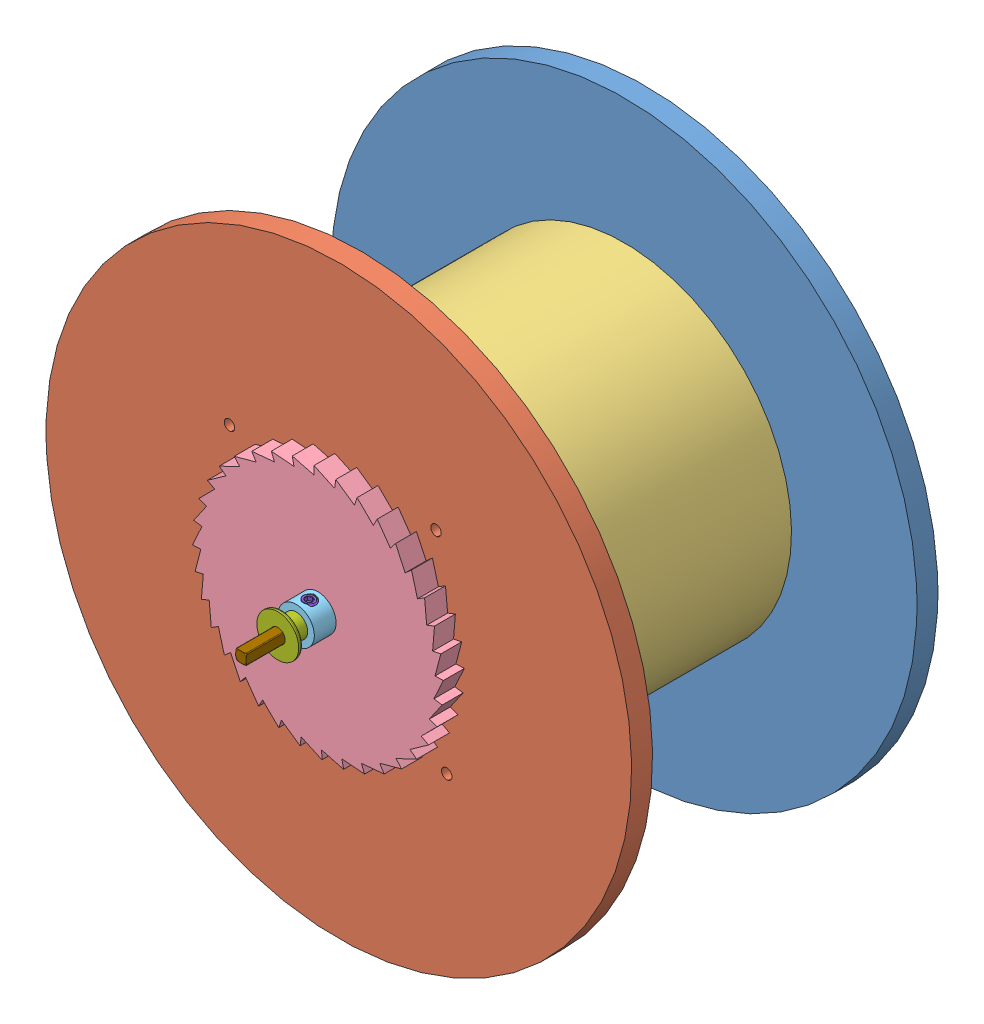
SolidWorks assembly Class Project Big Wheel.SLDASM, configuration Default (file format 10000). Lengths in mm.
Overall size (180.94 180.94 152.61).
12 component instances, 9 part files, 25 mates.
Components (placement in the parent):
- Big Spool part1-1: Big Spool part1.SLDPRT [Default] at (-48.379 96.7165 191.1816) size (177.8 177.8 6.35)
- Big Spool part2-1: Big Spool part2.SLDPRT [Default] at (-48.379 96.7165 277.7956) x (-0.999841 -0.017819 0) z (0 0 1) size (177.8 177.8 6.35)
- Big Spool part3-1: Big Spool part3.SLDPRT [Default] at (-48.379 96.7165 197.5316) x (-0.999916 -0.012987 0) z (0 0 1) size (101.6 101.6 80.26)
- Big Spool Rachet clamp-1: Big Spool Rachet clamp.SLDPRT [Default] at (-48.379 96.7165 290.4956) x (0.9995 0.031613 0) z (0 0 -1) size (76.2 76.2 12.7)
- Shaft Collar-1: Shaft Collar.SLDPRT [Default] at (-48.379 96.7165 293.7976) x (-0.994389 0.105789 0) z (0 0 1) size (11 11.03 6.6)
- Shaft Collar-2: Shaft Collar.SLDPRT [Default] at (-48.379 96.7165 181.5296) x (0.994389 -0.105789 0) z (0 0 -1) size (11 11.03 6.6)
- Big Spool clamp-1: Big Spool clamp.SLDPRT [Default] at (-48.379 96.7165 184.8316) size (76.2 76.2 12.7)
- Large wheel spacer-1: Large wheel spacer.SLDPRT [Default] at (-48.379 96.7165 297.0996) x (-0.992306 -0.123807 0) z (0 0 1) size (12.7 12.7 5.59)
- Large wheel spacer-2: Large wheel spacer.SLDPRT [Default] at (-48.379 96.7165 178.2276) x (-0.923728 -0.383049 0) z (0 0 -1) size (12.7 12.7 5.59)
- Vex Set Screw-1: Vex Set Screw.SLDPRT [91375A188] at (-47.9288 100.948 293.7976) x (0.501508 -0.053354 -0.863506) z (0.105789 0.994389 0) size (4.19 4.24 3.49)
- Vex Set Screw-2: Vex Set Screw.SLDPRT [91375A188] at (-47.9288 100.948 181.5296) x (-0.595958 0.063402 0.800509) z (0.105789 0.994389 0) size (4.19 4.24 3.49)
- Shaft 6in-1: Shaft 6in.SLDPRT [Default] at (-48.379 96.7165 161.4636) size (4.18 4.18 152.61)
Mates (geometry in assembly coordinates):
- Concentric1: concentric anti-aligned: cylinder of Big Spool part1-1 through (-48.379 96.7165 191.1816) axis (0 0 1) radius 28.575; cylinder of Big Spool clamp-1 through (-48.379 96.7165 197.5316) axis (0 0 -1) radius 28.575
- Coincident1: coincident anti-aligned: plane of Big Spool part1-1 through (-48.379 96.7165 191.1816) normal (0 0 -1); plane of Big Spool clamp-1 through (-48.379 96.7165 191.1816) normal (0 0 1)
- Concentric2: concentric aligned: cylinder of Big Spool part1-1 through (-48.379 96.7165 197.5316) axis (0 0 -1) radius 88.9; cylinder of Big Spool part3-1 through (-48.379 96.7165 277.7956) axis (0 0 -1) radius 50.8
- Coincident2: coincident anti-aligned: plane of Big Spool part1-1 through (-48.379 96.7165 197.5316) normal (0 0 1); plane of Big Spool part3-1 through (-48.379 96.7165 197.5316) normal (0 0 -1)
- Concentric3: concentric anti-aligned: cylinder of Big Spool part2-1 through (-81.5847 126.2662 284.1456) axis (0 0 -1) radius 1.5875; cylinder of Big Spool part3-1 through (-81.5847 126.2662 197.5316) axis (0 0 1) radius 1.651
- Coincident3: coincident anti-aligned: plane of Big Spool part2-1 through (-48.379 96.7165 277.7956) normal (0 0 -1); plane of Big Spool part3-1 through (-48.379 96.7165 277.7956) normal (0 0 1)
- Concentric4: concentric aligned: cylinder of Big Spool part2-1 through (-48.379 96.7165 277.7956) axis (0 0 1) radius 28.575; cylinder of Big Spool Rachet clamp-1 through (-48.379 96.7165 277.7956) axis (0 0 1) radius 28.575
- Coincident4: coincident anti-aligned: plane of Big Spool part2-1 through (-48.379 96.7165 284.1456) normal (0 0 1); plane of Big Spool Rachet clamp-1 through (-48.379 96.7165 284.1456) normal (0 0 -1)
- Coincident5: coincident anti-aligned: plane of Big Spool Rachet clamp-1 through (-48.379 96.7165 290.4956) normal (0 0 1); plane of Shaft Collar-1 through (-48.379 96.7165 290.4956) normal (0 0 -1)
- Concentric6: concentric anti-aligned: cylinder of Big Spool part2-1 through (-48.379 96.7165 284.1456) axis (0 0 -1) radius 88.9; cylinder of Shaft Collar-1 through (-48.379 96.7165 290.4956) axis (0 0 1) radius 5.5
- Coincident6: coincident anti-aligned: plane of Shaft Collar-2 through (-48.379 96.7165 184.8316) normal (0 0 1); plane of Big Spool clamp-1 through (-48.379 96.7165 184.8316) normal (0 0 -1)
- Concentric7: concentric aligned: cylinder of Big Spool part1-1 through (-48.379 96.7165 197.5316) axis (0 0 -1) radius 88.9; cylinder of Shaft Collar-2 through (-48.379 96.7165 184.8316) axis (0 0 -1) radius 5.5
- Concentric8: concentric aligned: cylinder of Big Spool part1-1 through (-48.379 96.7165 197.5316) axis (0 0 -1) radius 88.9; cylinder of Big Spool part2-1 through (-48.379 96.7165 284.1456) axis (0 0 -1) radius 88.9
- Coincident8: coincident anti-aligned: plane of Shaft Collar-2 through (-48.379 96.7165 178.2276) normal (0 0 -1); plane of Large wheel spacer-2 through (-48.379 96.7165 178.2276) normal (0 0 1)
- Concentric10: concentric anti-aligned: cylinder of Big Spool clamp-1 through (-48.379 96.7165 191.1816) axis (0 0 -1) radius 38.1; cylinder of Large wheel spacer-2 through (-48.379 96.7165 172.6396) axis (0 0 1) radius 3.4925
- Concentric11: concentric anti-aligned: cylinder of Shaft Collar-1 through (-48.379 96.7165 293.7976) axis (-0.105789 -0.994389 0) radius 2.0828; cylinder of Vex Set Screw-1 through (-48.0605 99.7104 293.7976) axis (0.105789 0.994389 0) radius 2.0828
- Tangent3: tangent aligned: cylinder of Shaft Collar-1 through (-48.379 96.7165 290.4956) axis (0 0 1) radius 5.5; plane of Vex Set Screw-1 through (-47.7971 102.1856 293.7976) normal (0.105789 0.994389 0)
- Concentric13: concentric anti-aligned: cylinder of Shaft Collar-2 through (-48.379 96.7165 181.5296) axis (-0.105789 -0.994389 0) radius 2.0828; cylinder of Vex Set Screw-2 through (-48.0605 99.7104 181.5296) axis (0.105789 0.994389 0) radius 2.0828
- Tangent4: tangent aligned: cylinder of Shaft Collar-2 through (-48.379 96.7165 184.8316) axis (0 0 -1) radius 5.5; plane of Vex Set Screw-2 through (-47.7971 102.1856 181.5296) normal (0.105789 0.994389 0)
- Parallel1: parallel aligned: plane of Vex Set Screw-1 through (-47.7971 102.1856 293.7976) normal (0.105789 0.994389 0); plane of Vex Set Screw-2 through (-47.7971 102.1856 181.5296) normal (0.105789 0.994389 0)
- Coincident9: coincident anti-aligned: plane of Shaft Collar-1 through (-48.379 96.7165 297.0996) normal (0 0 1); plane of Large wheel spacer-1 through (-48.379 96.7165 297.0996) normal (0 0 -1)
- Concentric14: concentric anti-aligned: cylinder of Shaft Collar-1 through (-48.379 96.7165 290.4956) axis (0 0 1) radius 5.5; cylinder of Large wheel spacer-1 through (-48.379 96.7165 302.6876) axis (0 0 -1) radius 3.4925
- Width1: width anti-aligned: plane of Shaft 6in-1 through (-49.9665 98.304 313.8636) normal (0 0 1); plane of Shaft 6in-1 through (-49.9665 98.304 161.4636) normal (0 0 -1); plane of Big Spool part1-1 through (-48.379 96.7165 191.1816) normal (0 0 -1); plane of Big Spool part2-1 through (-48.379 96.7165 284.1456) normal (0 0 1)
- Width2: width: plane of Shaft 6in-1 through (-46.7915 95.129 313.8636) normal (1 0 0); plane of Shaft 6in-1 through (-49.9665 95.129 313.8636) normal (-1 0 0); cylinder of Large wheel spacer-1 through (-48.379 96.7165 302.6876) axis (0 0 -1) radius 3.4925
- Width3: width: plane of Shaft 6in-1 through (-49.9665 98.304 313.8636) normal (0 1 0); plane of Shaft 6in-1 through (-49.9665 95.129 313.8636) normal (0 -1 0); cylinder of Large wheel spacer-1 through (-48.379 96.7165 302.6876) axis (0 0 -1) radius 3.4925
